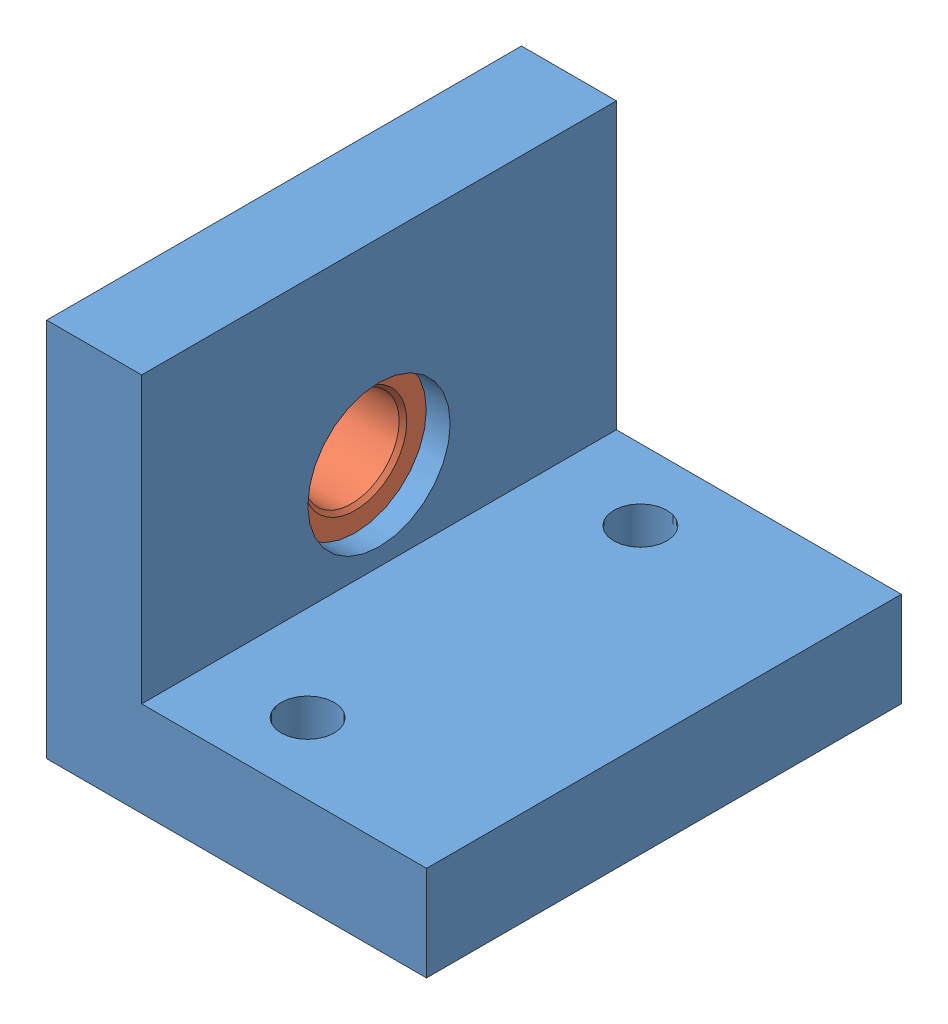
SolidWorks assembly Assem1.sldasm, configuration Default (file format 4400). Lengths in mm.
Overall size (27 25.4 31.75).
2 component instances, 2 part files, 2 mates.
Components (placement in the parent):
- Bushing Mount 2-1: Bushing Mount 2.SLDPRT [Default] at (-25.3873 3.5778 11.511) size (25.4 25.4 31.75)
- Bushing-1: Bushing.SLDPRT [Default] at (-25.3873 15.846 -4.364) size (6.35 12.7 12.7)
Mates (geometry in assembly coordinates):
- Concentric1: concentric: cylinder of Bushing Mount 2-1 through (0.0127 15.846 -4.364) axis (-1 0 0) radius 4.7625; cylinder of Bushing-1 through (-20.6375 15.846 -4.364) axis (-1 0 0) radius 4.7879
- Coincident1: coincident anti-aligned: plane of Bushing Mount 2-1 through (-25.3873 3.5778 -20.239) normal (-1 0 0); plane of Bushing-1 through (-25.3873 15.846 -4.364) normal (1 0 0)
